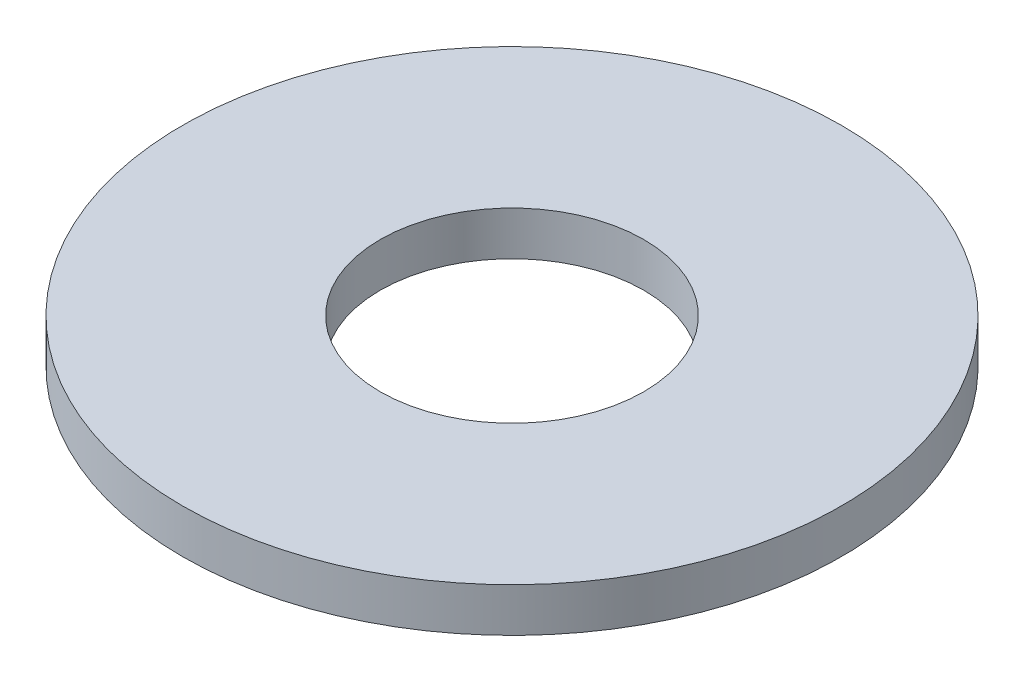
from build123d import *

# Parameters (mm, degrees)
SKETCH1_R      = 2.25
SKETCH1_R_2    = 0.9
EXTRUDE1_DEPTH = 0.3


with BuildPart() as part:
    # Sketch1 → Extrude1 (new body)
    with BuildSketch(Plane(origin=(0, 0, 0), x_dir=(1, 0, 0), z_dir=(0, 1, 0))):
        with Locations(Location((0, 0, 0), (0, 0, 270))):
            Circle(SKETCH1_R)
        with Locations(Location((0, 0, 0), (0, 0, 270))):
            Circle(SKETCH1_R_2, mode=Mode.SUBTRACT)
    extrude(amount=EXTRUDE1_DEPTH)


solid = part.part
